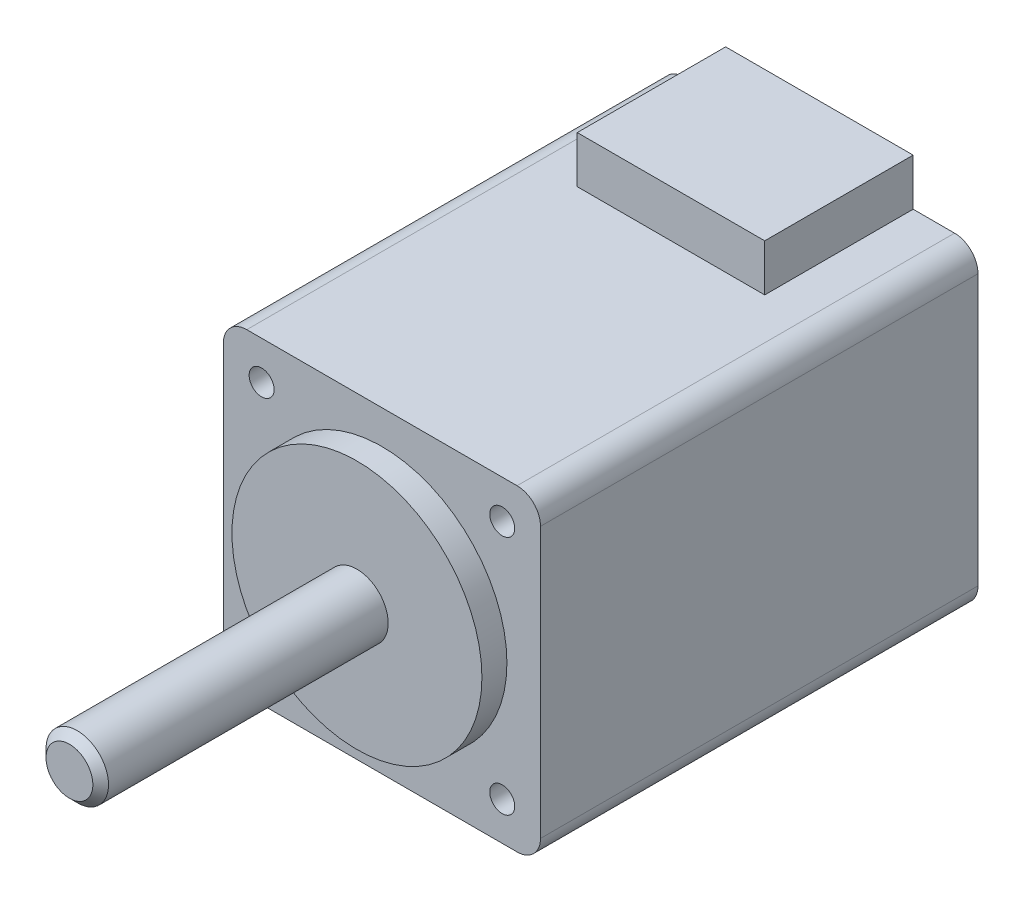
ISO-10303-21;
HEADER;
FILE_DESCRIPTION(('STEP AP214'),'2;1');
FILE_NAME('part.step','',(''),(''),'','','');
FILE_SCHEMA(('AUTOMOTIVE_DESIGN { 1 0 10303 214 1 1 1 1 }'));
ENDSEC;
DATA;
#1=APPLICATION_CONTEXT('core data for automotive mechanical design processes');
#2=APPLICATION_PROTOCOL_DEFINITION('international standard','automotive_design',2000,#1);
#3=PRODUCT_CONTEXT('',#1,'mechanical');
#4=PRODUCT('Part','Part','',(#3));
#5=PRODUCT_RELATED_PRODUCT_CATEGORY('part','',(#4));
#6=PRODUCT_DEFINITION_FORMATION('','',#4);
#7=PRODUCT_DEFINITION_CONTEXT('part definition',#1,'design');
#8=PRODUCT_DEFINITION('design','',#6,#7);
#9=PRODUCT_DEFINITION_SHAPE('','',#8);
#10=(LENGTH_UNIT() NAMED_UNIT(*) SI_UNIT(.MILLI.,.METRE.));
#11=(NAMED_UNIT(*) PLANE_ANGLE_UNIT() SI_UNIT($,.RADIAN.));
#12=(NAMED_UNIT(*) SI_UNIT($,.STERADIAN.) SOLID_ANGLE_UNIT());
#13=UNCERTAINTY_MEASURE_WITH_UNIT(LENGTH_MEASURE(1.E-05),#10,'distance_accuracy_value','');
#14=(GEOMETRIC_REPRESENTATION_CONTEXT(3) GLOBAL_UNCERTAINTY_ASSIGNED_CONTEXT((#13)) GLOBAL_UNIT_ASSIGNED_CONTEXT((#10,
#11,#12)) REPRESENTATION_CONTEXT('',''));
#15=CARTESIAN_POINT('',(0.,0.,0.));
#16=DIRECTION('',(0.,0.,1.));
#17=DIRECTION('',(1.,0.,0.));
#18=AXIS2_PLACEMENT_3D('',#15,#16,#17);
#19=CARTESIAN_POINT('',(0.,0.,0.));
#20=DIRECTION('',(0.,0.,1.));
#21=DIRECTION('',(1.,0.,0.));
#22=AXIS2_PLACEMENT_3D('',#19,#20,#21);
#23=PLANE('',#22);
#24=CARTESIAN_POINT('',(0.,0.,0.));
#25=DIRECTION('',(0.,0.,1.));
#26=DIRECTION('',(1.,0.,0.));
#27=AXIS2_PLACEMENT_3D('',#24,#25,#26);
#28=CIRCLE('',#27,8.);
#29=CARTESIAN_POINT('',(8.,0.,0.));
#30=VERTEX_POINT('',#29);
#31=EDGE_CURVE('E184',#30,#30,#28,.T.);
#32=ORIENTED_EDGE('',*,*,#31,.T.);
#33=EDGE_LOOP('',(#32));
#34=FACE_BOUND('',#33,.T.);
#35=CARTESIAN_POINT('',(0.,0.,0.));
#36=DIRECTION('',(0.,0.,1.));
#37=DIRECTION('',(1.,0.,0.));
#38=AXIS2_PLACEMENT_3D('',#35,#36,#37);
#39=CIRCLE('',#38,2.);
#40=CARTESIAN_POINT('',(2.,0.,0.));
#41=VERTEX_POINT('',#40);
#42=EDGE_CURVE('E181',#41,#41,#39,.T.);
#43=ORIENTED_EDGE('',*,*,#42,.F.);
#44=EDGE_LOOP('',(#43));
#45=FACE_BOUND('',#44,.T.);
#46=ADVANCED_FACE('F37',(#34,#45),#23,.T.);
#47=CARTESIAN_POINT('',(0.,0.,-1.6));
#48=DIRECTION('',(0.,0.,1.));
#49=DIRECTION('',(1.,0.,0.));
#50=AXIS2_PLACEMENT_3D('',#47,#48,#49);
#51=CYLINDRICAL_SURFACE('',#50,8.);
#52=CARTESIAN_POINT('',(0.,0.,-1.6));
#53=DIRECTION('',(0.,0.,1.));
#54=DIRECTION('',(1.,0.,0.));
#55=AXIS2_PLACEMENT_3D('',#52,#53,#54);
#56=CIRCLE('',#55,8.);
#57=CARTESIAN_POINT('',(8.,0.,-1.6));
#58=VERTEX_POINT('',#57);
#59=EDGE_CURVE('E178',#58,#58,#56,.F.);
#60=ORIENTED_EDGE('',*,*,#59,.F.);
#61=EDGE_LOOP('',(#60));
#62=FACE_BOUND('',#61,.T.);
#63=ORIENTED_EDGE('',*,*,#31,.F.);
#64=EDGE_LOOP('',(#63));
#65=FACE_BOUND('',#64,.T.);
#66=ADVANCED_FACE('F205',(#62,#65),#51,.T.);
#67=CARTESIAN_POINT('',(0.,0.,18.4));
#68=DIRECTION('',(0.,0.,-1.));
#69=DIRECTION('',(-1.,0.,0.));
#70=AXIS2_PLACEMENT_3D('',#67,#68,#69);
#71=CYLINDRICAL_SURFACE('',#70,2.);
#72=CARTESIAN_POINT('',(0.,0.,17.9));
#73=DIRECTION('',(0.,0.,1.));
#74=DIRECTION('',(1.,0.,0.));
#75=AXIS2_PLACEMENT_3D('',#72,#73,#74);
#76=CIRCLE('',#75,2.);
#77=CARTESIAN_POINT('',(2.,0.,17.9));
#78=VERTEX_POINT('',#77);
#79=EDGE_CURVE('E11',#78,#78,#76,.F.);
#80=ORIENTED_EDGE('',*,*,#79,.T.);
#81=EDGE_LOOP('',(#80));
#82=FACE_BOUND('',#81,.T.);
#83=ORIENTED_EDGE('',*,*,#42,.T.);
#84=EDGE_LOOP('',(#83));
#85=FACE_BOUND('',#84,.T.);
#86=ADVANCED_FACE('F201',(#82,#85),#71,.T.);
#87=CARTESIAN_POINT('',(0.,0.,18.4));
#88=DIRECTION('',(0.,0.,1.));
#89=DIRECTION('',(1.,0.,0.));
#90=AXIS2_PLACEMENT_3D('',#87,#88,#89);
#91=PLANE('',#90);
#92=CARTESIAN_POINT('',(0.,0.,18.4));
#93=DIRECTION('',(0.,0.,1.));
#94=DIRECTION('',(1.,0.,0.));
#95=AXIS2_PLACEMENT_3D('',#92,#93,#94);
#96=CIRCLE('',#95,1.5);
#97=CARTESIAN_POINT('',(1.5,0.,18.4));
#98=VERTEX_POINT('',#97);
#99=EDGE_CURVE('E45',#98,#98,#96,.T.);
#100=ORIENTED_EDGE('',*,*,#99,.T.);
#101=EDGE_LOOP('',(#100));
#102=FACE_BOUND('',#101,.T.);
#103=ADVANCED_FACE('F189',(#102),#91,.T.);
#104=CARTESIAN_POINT('',(0.,0.,18.4));
#105=DIRECTION('',(0.,0.,-1.));
#106=DIRECTION('',(-1.,0.,0.));
#107=AXIS2_PLACEMENT_3D('',#104,#105,#106);
#108=CONICAL_SURFACE('',#107,1.5,0.78539816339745);
#109=ORIENTED_EDGE('',*,*,#79,.F.);
#110=EDGE_LOOP('',(#109));
#111=FACE_BOUND('',#110,.T.);
#112=ORIENTED_EDGE('',*,*,#99,.F.);
#113=EDGE_LOOP('',(#112));
#114=FACE_BOUND('',#113,.T.);
#115=ADVANCED_FACE('F39',(#111,#114),#108,.T.);
#116=CARTESIAN_POINT('',(8.65,8.65,-29.6));
#117=DIRECTION('',(0.,0.,1.));
#118=DIRECTION('',(1.,0.,0.));
#119=AXIS2_PLACEMENT_3D('',#116,#117,#118);
#120=CYLINDRICAL_SURFACE('',#119,1.5);
#121=CARTESIAN_POINT('',(8.65,8.65,-1.6));
#122=DIRECTION('',(0.,0.,-1.));
#123=DIRECTION('',(1.,0.,0.));
#124=AXIS2_PLACEMENT_3D('',#121,#122,#123);
#125=CIRCLE('',#124,1.5);
#126=CARTESIAN_POINT('',(8.64999999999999,10.15,-1.6));
#127=VERTEX_POINT('',#126);
#128=CARTESIAN_POINT('',(10.15,8.64999999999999,-1.6));
#129=VERTEX_POINT('',#128);
#130=EDGE_CURVE('E148',#127,#129,#125,.T.);
#131=ORIENTED_EDGE('',*,*,#130,.T.);
#132=DIRECTION('',(0.,0.,1.));
#133=VECTOR('',#132,1.);
#134=CARTESIAN_POINT('',(10.15,8.64999999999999,-29.6));
#135=LINE('',#134,#133);
#136=CARTESIAN_POINT('',(10.15,8.64999999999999,-29.6));
#137=VERTEX_POINT('',#136);
#138=EDGE_CURVE('E172',#137,#129,#135,.T.);
#139=ORIENTED_EDGE('',*,*,#138,.F.);
#140=CARTESIAN_POINT('',(8.65,8.65,-29.6));
#141=DIRECTION('',(0.,0.,-1.));
#142=DIRECTION('',(1.,0.,0.));
#143=AXIS2_PLACEMENT_3D('',#140,#141,#142);
#144=CIRCLE('',#143,1.5);
#145=CARTESIAN_POINT('',(8.64999999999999,10.15,-29.6));
#146=VERTEX_POINT('',#145);
#147=EDGE_CURVE('E349',#146,#137,#144,.T.);
#148=ORIENTED_EDGE('',*,*,#147,.F.);
#149=DIRECTION('',(0.,0.,1.));
#150=VECTOR('',#149,1.);
#151=CARTESIAN_POINT('',(8.64999999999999,10.15,-29.6));
#152=LINE('',#151,#150);
#153=EDGE_CURVE('E175',#146,#127,#152,.T.);
#154=ORIENTED_EDGE('',*,*,#153,.T.);
#155=EDGE_LOOP('',(#131,#139,#148,#154));
#156=FACE_BOUND('',#155,.T.);
#157=ADVANCED_FACE('F192',(#156),#120,.T.);
#158=CARTESIAN_POINT('',(10.15,-8.65,-29.6));
#159=DIRECTION('',(-1.,0.,0.));
#160=DIRECTION('',(0.,0.,1.));
#161=AXIS2_PLACEMENT_3D('',#158,#159,#160);
#162=PLANE('',#161);
#163=DIRECTION('',(0.,-1.,0.));
#164=VECTOR('',#163,1.);
#165=CARTESIAN_POINT('',(10.15,-8.65,-1.6));
#166=LINE('',#165,#164);
#167=CARTESIAN_POINT('',(10.15,-8.65,-1.6));
#168=VERTEX_POINT('',#167);
#169=EDGE_CURVE('E150',#129,#168,#166,.T.);
#170=ORIENTED_EDGE('',*,*,#169,.T.);
#171=DIRECTION('',(0.,0.,1.));
#172=VECTOR('',#171,1.);
#173=CARTESIAN_POINT('',(10.15,-8.65,-29.6));
#174=LINE('',#173,#172);
#175=CARTESIAN_POINT('',(10.15,-8.65,-29.6));
#176=VERTEX_POINT('',#175);
#177=EDGE_CURVE('E169',#176,#168,#174,.T.);
#178=ORIENTED_EDGE('',*,*,#177,.F.);
#179=DIRECTION('',(0.,-1.,0.));
#180=VECTOR('',#179,1.);
#181=CARTESIAN_POINT('',(10.15,-8.65,-29.6));
#182=LINE('',#181,#180);
#183=EDGE_CURVE('E351',#137,#176,#182,.T.);
#184=ORIENTED_EDGE('',*,*,#183,.F.);
#185=ORIENTED_EDGE('',*,*,#138,.T.);
#186=EDGE_LOOP('',(#170,#178,#184,#185));
#187=FACE_BOUND('',#186,.T.);
#188=ADVANCED_FACE('F198',(#187),#162,.F.);
#189=CARTESIAN_POINT('',(8.65,-8.65000000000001,-29.6));
#190=DIRECTION('',(0.,0.,1.));
#191=DIRECTION('',(1.,0.,0.));
#192=AXIS2_PLACEMENT_3D('',#189,#190,#191);
#193=CYLINDRICAL_SURFACE('',#192,1.5);
#194=CARTESIAN_POINT('',(8.65,-8.65000000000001,-1.6));
#195=DIRECTION('',(0.,0.,-1.));
#196=DIRECTION('',(1.,0.,0.));
#197=AXIS2_PLACEMENT_3D('',#194,#195,#196);
#198=CIRCLE('',#197,1.5);
#199=CARTESIAN_POINT('',(8.64999999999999,-10.15,-1.6));
#200=VERTEX_POINT('',#199);
#201=EDGE_CURVE('E153',#168,#200,#198,.T.);
#202=ORIENTED_EDGE('',*,*,#201,.T.);
#203=DIRECTION('',(0.,0.,1.));
#204=VECTOR('',#203,1.);
#205=CARTESIAN_POINT('',(8.64999999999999,-10.15,-29.6));
#206=LINE('',#205,#204);
#207=CARTESIAN_POINT('',(8.64999999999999,-10.15,-29.6));
#208=VERTEX_POINT('',#207);
#209=EDGE_CURVE('E166',#208,#200,#206,.T.);
#210=ORIENTED_EDGE('',*,*,#209,.F.);
#211=CARTESIAN_POINT('',(8.65,-8.65000000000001,-29.6));
#212=DIRECTION('',(0.,0.,-1.));
#213=DIRECTION('',(1.,0.,0.));
#214=AXIS2_PLACEMENT_3D('',#211,#212,#213);
#215=CIRCLE('',#214,1.5);
#216=EDGE_CURVE('E353',#176,#208,#215,.T.);
#217=ORIENTED_EDGE('',*,*,#216,.F.);
#218=ORIENTED_EDGE('',*,*,#177,.T.);
#219=EDGE_LOOP('',(#202,#210,#217,#218));
#220=FACE_BOUND('',#219,.T.);
#221=ADVANCED_FACE('F219',(#220),#193,.T.);
#222=CARTESIAN_POINT('',(-8.64999999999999,-10.15,-29.6));
#223=DIRECTION('',(0.,1.,0.));
#224=DIRECTION('',(-1.,0.,0.));
#225=AXIS2_PLACEMENT_3D('',#222,#223,#224);
#226=PLANE('',#225);
#227=DIRECTION('',(-1.,0.,0.));
#228=VECTOR('',#227,1.);
#229=CARTESIAN_POINT('',(-8.64999999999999,-10.15,-1.6));
#230=LINE('',#229,#228);
#231=CARTESIAN_POINT('',(-8.64999999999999,-10.15,-1.6));
#232=VERTEX_POINT('',#231);
#233=EDGE_CURVE('E155',#200,#232,#230,.T.);
#234=ORIENTED_EDGE('',*,*,#233,.T.);
#235=DIRECTION('',(0.,0.,1.));
#236=VECTOR('',#235,1.);
#237=CARTESIAN_POINT('',(-8.64999999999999,-10.15,-29.6));
#238=LINE('',#237,#236);
#239=CARTESIAN_POINT('',(-8.64999999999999,-10.15,-29.6));
#240=VERTEX_POINT('',#239);
#241=EDGE_CURVE('E137',#240,#232,#238,.T.);
#242=ORIENTED_EDGE('',*,*,#241,.F.);
#243=DIRECTION('',(-1.,0.,0.));
#244=VECTOR('',#243,1.);
#245=CARTESIAN_POINT('',(-8.64999999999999,-10.15,-29.6));
#246=LINE('',#245,#244);
#247=EDGE_CURVE('E125',#208,#240,#246,.T.);
#248=ORIENTED_EDGE('',*,*,#247,.F.);
#249=ORIENTED_EDGE('',*,*,#209,.T.);
#250=EDGE_LOOP('',(#234,#242,#248,#249));
#251=FACE_BOUND('',#250,.T.);
#252=ADVANCED_FACE('F223',(#251),#226,.F.);
#253=CARTESIAN_POINT('',(-8.65,-8.65,-29.6));
#254=DIRECTION('',(0.,0.,1.));
#255=DIRECTION('',(1.,0.,0.));
#256=AXIS2_PLACEMENT_3D('',#253,#254,#255);
#257=CYLINDRICAL_SURFACE('',#256,1.5);
#258=CARTESIAN_POINT('',(-8.65,-8.65,-1.6));
#259=DIRECTION('',(0.,0.,-1.));
#260=DIRECTION('',(1.,0.,0.));
#261=AXIS2_PLACEMENT_3D('',#258,#259,#260);
#262=CIRCLE('',#261,1.5);
#263=CARTESIAN_POINT('',(-10.15,-8.64999999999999,-1.6));
#264=VERTEX_POINT('',#263);
#265=EDGE_CURVE('E134',#232,#264,#262,.T.);
#266=ORIENTED_EDGE('',*,*,#265,.T.);
#267=DIRECTION('',(0.,0.,1.));
#268=VECTOR('',#267,1.);
#269=CARTESIAN_POINT('',(-10.15,-8.64999999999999,-29.6));
#270=LINE('',#269,#268);
#271=CARTESIAN_POINT('',(-10.15,-8.64999999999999,-29.6));
#272=VERTEX_POINT('',#271);
#273=EDGE_CURVE('E131',#272,#264,#270,.T.);
#274=ORIENTED_EDGE('',*,*,#273,.F.);
#275=CARTESIAN_POINT('',(-8.65,-8.65,-29.6));
#276=DIRECTION('',(0.,0.,-1.));
#277=DIRECTION('',(1.,0.,0.));
#278=AXIS2_PLACEMENT_3D('',#275,#276,#277);
#279=CIRCLE('',#278,1.5);
#280=EDGE_CURVE('E118',#240,#272,#279,.T.);
#281=ORIENTED_EDGE('',*,*,#280,.F.);
#282=ORIENTED_EDGE('',*,*,#241,.T.);
#283=EDGE_LOOP('',(#266,#274,#281,#282));
#284=FACE_BOUND('',#283,.T.);
#285=ADVANCED_FACE('F132',(#284),#257,.T.);
#286=CARTESIAN_POINT('',(-10.15,8.64999999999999,-29.6));
#287=DIRECTION('',(1.,0.,0.));
#288=DIRECTION('',(0.,1.,0.));
#289=AXIS2_PLACEMENT_3D('',#286,#287,#288);
#290=PLANE('',#289);
#291=DIRECTION('',(0.,1.,0.));
#292=VECTOR('',#291,1.);
#293=CARTESIAN_POINT('',(-10.15,8.64999999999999,-1.6));
#294=LINE('',#293,#292);
#295=CARTESIAN_POINT('',(-10.15,8.64999999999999,-1.6));
#296=VERTEX_POINT('',#295);
#297=EDGE_CURVE('E158',#264,#296,#294,.T.);
#298=ORIENTED_EDGE('',*,*,#297,.T.);
#299=DIRECTION('',(0.,0.,1.));
#300=VECTOR('',#299,1.);
#301=CARTESIAN_POINT('',(-10.15,8.64999999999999,-29.6));
#302=LINE('',#301,#300);
#303=CARTESIAN_POINT('',(-10.15,8.64999999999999,-29.6));
#304=VERTEX_POINT('',#303);
#305=EDGE_CURVE('E138',#304,#296,#302,.T.);
#306=ORIENTED_EDGE('',*,*,#305,.F.);
#307=DIRECTION('',(0.,1.,0.));
#308=VECTOR('',#307,1.);
#309=CARTESIAN_POINT('',(-10.15,8.64999999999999,-29.6));
#310=LINE('',#309,#308);
#311=EDGE_CURVE('E122',#272,#304,#310,.T.);
#312=ORIENTED_EDGE('',*,*,#311,.F.);
#313=ORIENTED_EDGE('',*,*,#273,.T.);
#314=EDGE_LOOP('',(#298,#306,#312,#313));
#315=FACE_BOUND('',#314,.T.);
#316=ADVANCED_FACE('F140',(#315),#290,.F.);
#317=CARTESIAN_POINT('',(-8.65,8.65,-29.6));
#318=DIRECTION('',(0.,0.,1.));
#319=DIRECTION('',(1.,0.,0.));
#320=AXIS2_PLACEMENT_3D('',#317,#318,#319);
#321=CYLINDRICAL_SURFACE('',#320,1.5);
#322=CARTESIAN_POINT('',(-8.65,8.65,-1.6));
#323=DIRECTION('',(0.,0.,-1.));
#324=DIRECTION('',(1.,0.,0.));
#325=AXIS2_PLACEMENT_3D('',#322,#323,#324);
#326=CIRCLE('',#325,1.5);
#327=CARTESIAN_POINT('',(-8.64999999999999,10.15,-1.6));
#328=VERTEX_POINT('',#327);
#329=EDGE_CURVE('E96',#296,#328,#326,.T.);
#330=ORIENTED_EDGE('',*,*,#329,.T.);
#331=DIRECTION('',(0.,0.,1.));
#332=VECTOR('',#331,1.);
#333=CARTESIAN_POINT('',(-8.64999999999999,10.15,-29.6));
#334=LINE('',#333,#332);
#335=CARTESIAN_POINT('',(-8.64999999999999,10.15,-29.6));
#336=VERTEX_POINT('',#335);
#337=EDGE_CURVE('E144',#336,#328,#334,.T.);
#338=ORIENTED_EDGE('',*,*,#337,.F.);
#339=CARTESIAN_POINT('',(-8.65,8.65,-29.6));
#340=DIRECTION('',(0.,0.,-1.));
#341=DIRECTION('',(1.,0.,0.));
#342=AXIS2_PLACEMENT_3D('',#339,#340,#341);
#343=CIRCLE('',#342,1.5);
#344=EDGE_CURVE('E142',#304,#336,#343,.T.);
#345=ORIENTED_EDGE('',*,*,#344,.F.);
#346=ORIENTED_EDGE('',*,*,#305,.T.);
#347=EDGE_LOOP('',(#330,#338,#345,#346));
#348=FACE_BOUND('',#347,.T.);
#349=ADVANCED_FACE('F232',(#348),#321,.T.);
#350=CARTESIAN_POINT('',(0.,10.15,-29.6));
#351=DIRECTION('',(0.,-1.,0.));
#352=DIRECTION('',(0.,0.,-1.));
#353=AXIS2_PLACEMENT_3D('',#350,#351,#352);
#354=PLANE('',#353);
#355=DIRECTION('',(1.,0.,0.));
#356=VECTOR('',#355,1.);
#357=CARTESIAN_POINT('',(8.64999999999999,10.15,-29.6));
#358=LINE('',#357,#356);
#359=CARTESIAN_POINT('',(6.,10.15,-29.6));
#360=VERTEX_POINT('',#359);
#361=EDGE_CURVE('E101',#360,#146,#358,.T.);
#362=ORIENTED_EDGE('',*,*,#361,.F.);
#363=DIRECTION('',(0.,0.,-1.));
#364=VECTOR('',#363,1.);
#365=CARTESIAN_POINT('',(6.,10.15,-20.1));
#366=LINE('',#365,#364);
#367=CARTESIAN_POINT('',(6.,10.15,-20.1));
#368=VERTEX_POINT('',#367);
#369=EDGE_CURVE('E151',#368,#360,#366,.T.);
#370=ORIENTED_EDGE('',*,*,#369,.F.);
#371=DIRECTION('',(-1.,0.,0.));
#372=VECTOR('',#371,1.);
#373=CARTESIAN_POINT('',(6.,10.15,-20.1));
#374=LINE('',#373,#372);
#375=CARTESIAN_POINT('',(-6.,10.15,-20.1));
#376=VERTEX_POINT('',#375);
#377=EDGE_CURVE('E322',#368,#376,#374,.T.);
#378=ORIENTED_EDGE('',*,*,#377,.T.);
#379=DIRECTION('',(0.,0.,-1.));
#380=VECTOR('',#379,1.);
#381=CARTESIAN_POINT('',(-6.,10.15,-20.1));
#382=LINE('',#381,#380);
#383=CARTESIAN_POINT('',(-6.,10.15,-29.6));
#384=VERTEX_POINT('',#383);
#385=EDGE_CURVE('E334',#376,#384,#382,.T.);
#386=ORIENTED_EDGE('',*,*,#385,.T.);
#387=EDGE_CURVE('E61',#336,#384,#358,.T.);
#388=ORIENTED_EDGE('',*,*,#387,.F.);
#389=ORIENTED_EDGE('',*,*,#337,.T.);
#390=DIRECTION('',(1.,0.,0.));
#391=VECTOR('',#390,1.);
#392=CARTESIAN_POINT('',(0.,10.15,-1.6));
#393=LINE('',#392,#391);
#394=EDGE_CURVE('E161',#328,#127,#393,.T.);
#395=ORIENTED_EDGE('',*,*,#394,.T.);
#396=ORIENTED_EDGE('',*,*,#153,.F.);
#397=EDGE_LOOP('',(#362,#370,#378,#386,#388,#389,#395,#396));
#398=FACE_BOUND('',#397,.T.);
#399=ADVANCED_FACE('F235',(#398),#354,.F.);
#400=CARTESIAN_POINT('',(-8.65,8.65,-29.6));
#401=DIRECTION('',(0.,0.,1.));
#402=DIRECTION('',(1.,0.,0.));
#403=AXIS2_PLACEMENT_3D('',#400,#401,#402);
#404=PLANE('',#403);
#405=ORIENTED_EDGE('',*,*,#387,.T.);
#406=DIRECTION('',(0.,1.,0.));
#407=VECTOR('',#406,1.);
#408=CARTESIAN_POINT('',(-6.,10.15,-29.6));
#409=LINE('',#408,#407);
#410=CARTESIAN_POINT('',(-6.,13.15,-29.6));
#411=VERTEX_POINT('',#410);
#412=EDGE_CURVE('E321',#384,#411,#409,.T.);
#413=ORIENTED_EDGE('',*,*,#412,.T.);
#414=DIRECTION('',(1.,0.,0.));
#415=VECTOR('',#414,1.);
#416=CARTESIAN_POINT('',(-6.,13.15,-29.6));
#417=LINE('',#416,#415);
#418=CARTESIAN_POINT('',(6.,13.15,-29.6));
#419=VERTEX_POINT('',#418);
#420=EDGE_CURVE('E337',#411,#419,#417,.T.);
#421=ORIENTED_EDGE('',*,*,#420,.T.);
#422=DIRECTION('',(0.,-1.,0.));
#423=VECTOR('',#422,1.);
#424=CARTESIAN_POINT('',(6.,13.15,-29.6));
#425=LINE('',#424,#423);
#426=EDGE_CURVE('E52',#419,#360,#425,.T.);
#427=ORIENTED_EDGE('',*,*,#426,.T.);
#428=ORIENTED_EDGE('',*,*,#361,.T.);
#429=ORIENTED_EDGE('',*,*,#147,.T.);
#430=ORIENTED_EDGE('',*,*,#183,.T.);
#431=ORIENTED_EDGE('',*,*,#216,.T.);
#432=ORIENTED_EDGE('',*,*,#247,.T.);
#433=ORIENTED_EDGE('',*,*,#280,.T.);
#434=ORIENTED_EDGE('',*,*,#311,.T.);
#435=ORIENTED_EDGE('',*,*,#344,.T.);
#436=EDGE_LOOP('',(#405,#413,#421,#427,#428,#429,#430,#431,#432,#433,#434,#435));
#437=FACE_BOUND('',#436,.T.);
#438=ADVANCED_FACE('F120',(#437),#404,.F.);
#439=CARTESIAN_POINT('',(-8.65,8.65,-1.6));
#440=DIRECTION('',(0.,0.,1.));
#441=DIRECTION('',(1.,0.,0.));
#442=AXIS2_PLACEMENT_3D('',#439,#440,#441);
#443=PLANE('',#442);
#444=CARTESIAN_POINT('',(-7.7,7.7,-1.6));
#445=DIRECTION('',(0.,0.,1.));
#446=DIRECTION('',(1.,0.,0.));
#447=AXIS2_PLACEMENT_3D('',#444,#445,#446);
#448=CIRCLE('',#447,0.799999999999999);
#449=CARTESIAN_POINT('',(-6.9,7.7,-1.6));
#450=VERTEX_POINT('',#449);
#451=EDGE_CURVE('E299',#450,#450,#448,.T.);
#452=ORIENTED_EDGE('',*,*,#451,.F.);
#453=EDGE_LOOP('',(#452));
#454=FACE_BOUND('',#453,.T.);
#455=CARTESIAN_POINT('',(7.7,7.7,-1.6));
#456=DIRECTION('',(0.,0.,1.));
#457=DIRECTION('',(1.,0.,0.));
#458=AXIS2_PLACEMENT_3D('',#455,#456,#457);
#459=CIRCLE('',#458,0.799999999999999);
#460=CARTESIAN_POINT('',(8.5,7.7,-1.6));
#461=VERTEX_POINT('',#460);
#462=EDGE_CURVE('E301',#461,#461,#459,.T.);
#463=ORIENTED_EDGE('',*,*,#462,.F.);
#464=EDGE_LOOP('',(#463));
#465=FACE_BOUND('',#464,.T.);
#466=CARTESIAN_POINT('',(7.7,-7.7,-1.6));
#467=DIRECTION('',(0.,0.,1.));
#468=DIRECTION('',(1.,0.,0.));
#469=AXIS2_PLACEMENT_3D('',#466,#467,#468);
#470=CIRCLE('',#469,0.799999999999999);
#471=CARTESIAN_POINT('',(8.5,-7.7,-1.6));
#472=VERTEX_POINT('',#471);
#473=EDGE_CURVE('E309',#472,#472,#470,.T.);
#474=ORIENTED_EDGE('',*,*,#473,.F.);
#475=EDGE_LOOP('',(#474));
#476=FACE_BOUND('',#475,.T.);
#477=CARTESIAN_POINT('',(-7.7,-7.7,-1.6));
#478=DIRECTION('',(0.,0.,1.));
#479=DIRECTION('',(1.,0.,0.));
#480=AXIS2_PLACEMENT_3D('',#477,#478,#479);
#481=CIRCLE('',#480,0.799999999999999);
#482=CARTESIAN_POINT('',(-6.9,-7.7,-1.6));
#483=VERTEX_POINT('',#482);
#484=EDGE_CURVE('E315',#483,#483,#481,.T.);
#485=ORIENTED_EDGE('',*,*,#484,.F.);
#486=EDGE_LOOP('',(#485));
#487=FACE_BOUND('',#486,.T.);
#488=ORIENTED_EDGE('',*,*,#59,.T.);
#489=EDGE_LOOP('',(#488));
#490=FACE_BOUND('',#489,.T.);
#491=ORIENTED_EDGE('',*,*,#130,.F.);
#492=ORIENTED_EDGE('',*,*,#394,.F.);
#493=ORIENTED_EDGE('',*,*,#329,.F.);
#494=ORIENTED_EDGE('',*,*,#297,.F.);
#495=ORIENTED_EDGE('',*,*,#265,.F.);
#496=ORIENTED_EDGE('',*,*,#233,.F.);
#497=ORIENTED_EDGE('',*,*,#201,.F.);
#498=ORIENTED_EDGE('',*,*,#169,.F.);
#499=EDGE_LOOP('',(#491,#492,#493,#494,#495,#496,#497,#498));
#500=FACE_BOUND('',#499,.T.);
#501=ADVANCED_FACE('F238',(#454,#465,#476,#487,#490,#500),#443,.T.);
#502=CARTESIAN_POINT('',(6.,13.15,-20.1));
#503=DIRECTION('',(1.,0.,0.));
#504=DIRECTION('',(0.,1.,0.));
#505=AXIS2_PLACEMENT_3D('',#502,#503,#504);
#506=PLANE('',#505);
#507=ORIENTED_EDGE('',*,*,#426,.F.);
#508=DIRECTION('',(0.,0.,-1.));
#509=VECTOR('',#508,1.);
#510=CARTESIAN_POINT('',(6.,13.15,-20.1));
#511=LINE('',#510,#509);
#512=CARTESIAN_POINT('',(6.,13.15,-20.1));
#513=VERTEX_POINT('',#512);
#514=EDGE_CURVE('E341',#513,#419,#511,.T.);
#515=ORIENTED_EDGE('',*,*,#514,.F.);
#516=DIRECTION('',(0.,-1.,0.));
#517=VECTOR('',#516,1.);
#518=CARTESIAN_POINT('',(6.,13.15,-20.1));
#519=LINE('',#518,#517);
#520=EDGE_CURVE('E331',#513,#368,#519,.T.);
#521=ORIENTED_EDGE('',*,*,#520,.T.);
#522=ORIENTED_EDGE('',*,*,#369,.T.);
#523=EDGE_LOOP('',(#507,#515,#521,#522));
#524=FACE_BOUND('',#523,.T.);
#525=ADVANCED_FACE('F241',(#524),#506,.T.);
#526=CARTESIAN_POINT('',(-6.,13.15,-20.1));
#527=DIRECTION('',(0.,1.,0.));
#528=DIRECTION('',(-1.,0.,0.));
#529=AXIS2_PLACEMENT_3D('',#526,#527,#528);
#530=PLANE('',#529);
#531=ORIENTED_EDGE('',*,*,#420,.F.);
#532=DIRECTION('',(0.,0.,-1.));
#533=VECTOR('',#532,1.);
#534=CARTESIAN_POINT('',(-6.,13.15,-20.1));
#535=LINE('',#534,#533);
#536=CARTESIAN_POINT('',(-6.,13.15,-20.1));
#537=VERTEX_POINT('',#536);
#538=EDGE_CURVE('E344',#537,#411,#535,.T.);
#539=ORIENTED_EDGE('',*,*,#538,.F.);
#540=DIRECTION('',(1.,0.,0.));
#541=VECTOR('',#540,1.);
#542=CARTESIAN_POINT('',(-6.,13.15,-20.1));
#543=LINE('',#542,#541);
#544=EDGE_CURVE('E328',#537,#513,#543,.T.);
#545=ORIENTED_EDGE('',*,*,#544,.T.);
#546=ORIENTED_EDGE('',*,*,#514,.T.);
#547=EDGE_LOOP('',(#531,#539,#545,#546));
#548=FACE_BOUND('',#547,.T.);
#549=ADVANCED_FACE('F249',(#548),#530,.T.);
#550=CARTESIAN_POINT('',(-6.,10.15,-20.1));
#551=DIRECTION('',(-1.,0.,0.));
#552=DIRECTION('',(0.,0.,1.));
#553=AXIS2_PLACEMENT_3D('',#550,#551,#552);
#554=PLANE('',#553);
#555=ORIENTED_EDGE('',*,*,#412,.F.);
#556=ORIENTED_EDGE('',*,*,#385,.F.);
#557=DIRECTION('',(0.,1.,0.));
#558=VECTOR('',#557,1.);
#559=CARTESIAN_POINT('',(-6.,10.15,-20.1));
#560=LINE('',#559,#558);
#561=EDGE_CURVE('E325',#376,#537,#560,.T.);
#562=ORIENTED_EDGE('',*,*,#561,.T.);
#563=ORIENTED_EDGE('',*,*,#538,.T.);
#564=EDGE_LOOP('',(#555,#556,#562,#563));
#565=FACE_BOUND('',#564,.T.);
#566=ADVANCED_FACE('F245',(#565),#554,.T.);
#567=CARTESIAN_POINT('',(0.,0.,-20.1));
#568=DIRECTION('',(0.,0.,-1.));
#569=DIRECTION('',(-1.,0.,0.));
#570=AXIS2_PLACEMENT_3D('',#567,#568,#569);
#571=PLANE('',#570);
#572=ORIENTED_EDGE('',*,*,#377,.F.);
#573=ORIENTED_EDGE('',*,*,#520,.F.);
#574=ORIENTED_EDGE('',*,*,#544,.F.);
#575=ORIENTED_EDGE('',*,*,#561,.F.);
#576=EDGE_LOOP('',(#572,#573,#574,#575));
#577=FACE_BOUND('',#576,.T.);
#578=ADVANCED_FACE('F248',(#577),#571,.F.);
#579=CARTESIAN_POINT('',(-7.7,-7.7,-7.1));
#580=DIRECTION('',(0.,0.,1.));
#581=DIRECTION('',(1.,0.,0.));
#582=AXIS2_PLACEMENT_3D('',#579,#580,#581);
#583=CONICAL_SURFACE('',#582,0.799999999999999,1.02974425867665);
#584=CARTESIAN_POINT('',(-7.7,-7.7,-7.58068849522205));
#585=VERTEX_POINT('',#584);
#586=VERTEX_LOOP('',#585);
#587=FACE_BOUND('',#586,.T.);
#588=CARTESIAN_POINT('',(-7.7,-7.7,-7.1));
#589=DIRECTION('',(0.,0.,1.));
#590=DIRECTION('',(1.,0.,0.));
#591=AXIS2_PLACEMENT_3D('',#588,#589,#590);
#592=CIRCLE('',#591,0.799999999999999);
#593=CARTESIAN_POINT('',(-6.9,-7.7,-7.1));
#594=VERTEX_POINT('',#593);
#595=EDGE_CURVE('E318',#594,#594,#592,.T.);
#596=ORIENTED_EDGE('',*,*,#595,.T.);
#597=EDGE_LOOP('',(#596));
#598=FACE_BOUND('',#597,.T.);
#599=ADVANCED_FACE('F259',(#587,#598),#583,.F.);
#600=CARTESIAN_POINT('',(-7.7,-7.7,-1.6));
#601=DIRECTION('',(0.,0.,1.));
#602=DIRECTION('',(1.,0.,0.));
#603=AXIS2_PLACEMENT_3D('',#600,#601,#602);
#604=CYLINDRICAL_SURFACE('',#603,0.799999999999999);
#605=ORIENTED_EDGE('',*,*,#595,.F.);
#606=EDGE_LOOP('',(#605));
#607=FACE_BOUND('',#606,.T.);
#608=ORIENTED_EDGE('',*,*,#484,.T.);
#609=EDGE_LOOP('',(#608));
#610=FACE_BOUND('',#609,.T.);
#611=ADVANCED_FACE('F263',(#607,#610),#604,.F.);
#612=CARTESIAN_POINT('',(7.7,-7.7,-7.1));
#613=DIRECTION('',(0.,0.,1.));
#614=DIRECTION('',(1.,0.,0.));
#615=AXIS2_PLACEMENT_3D('',#612,#613,#614);
#616=CONICAL_SURFACE('',#615,0.799999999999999,1.02974425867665);
#617=CARTESIAN_POINT('',(7.7,-7.7,-7.58068849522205));
#618=VERTEX_POINT('',#617);
#619=VERTEX_LOOP('',#618);
#620=FACE_BOUND('',#619,.T.);
#621=CARTESIAN_POINT('',(7.7,-7.7,-7.1));
#622=DIRECTION('',(0.,0.,1.));
#623=DIRECTION('',(1.,0.,0.));
#624=AXIS2_PLACEMENT_3D('',#621,#622,#623);
#625=CIRCLE('',#624,0.799999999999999);
#626=CARTESIAN_POINT('',(8.5,-7.7,-7.1));
#627=VERTEX_POINT('',#626);
#628=EDGE_CURVE('E312',#627,#627,#625,.T.);
#629=ORIENTED_EDGE('',*,*,#628,.T.);
#630=EDGE_LOOP('',(#629));
#631=FACE_BOUND('',#630,.T.);
#632=ADVANCED_FACE('F267',(#620,#631),#616,.F.);
#633=CARTESIAN_POINT('',(7.7,-7.7,-1.6));
#634=DIRECTION('',(0.,0.,1.));
#635=DIRECTION('',(1.,0.,0.));
#636=AXIS2_PLACEMENT_3D('',#633,#634,#635);
#637=CYLINDRICAL_SURFACE('',#636,0.799999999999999);
#638=ORIENTED_EDGE('',*,*,#628,.F.);
#639=EDGE_LOOP('',(#638));
#640=FACE_BOUND('',#639,.T.);
#641=ORIENTED_EDGE('',*,*,#473,.T.);
#642=EDGE_LOOP('',(#641));
#643=FACE_BOUND('',#642,.T.);
#644=ADVANCED_FACE('F271',(#640,#643),#637,.F.);
#645=CARTESIAN_POINT('',(7.7,7.7,-7.1));
#646=DIRECTION('',(0.,0.,1.));
#647=DIRECTION('',(1.,0.,0.));
#648=AXIS2_PLACEMENT_3D('',#645,#646,#647);
#649=CONICAL_SURFACE('',#648,0.799999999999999,1.02974425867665);
#650=CARTESIAN_POINT('',(7.7,7.7,-7.58068849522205));
#651=VERTEX_POINT('',#650);
#652=VERTEX_LOOP('',#651);
#653=FACE_BOUND('',#652,.T.);
#654=CARTESIAN_POINT('',(7.7,7.7,-7.1));
#655=DIRECTION('',(0.,0.,1.));
#656=DIRECTION('',(1.,0.,0.));
#657=AXIS2_PLACEMENT_3D('',#654,#655,#656);
#658=CIRCLE('',#657,0.799999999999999);
#659=CARTESIAN_POINT('',(8.5,7.7,-7.1));
#660=VERTEX_POINT('',#659);
#661=EDGE_CURVE('E306',#660,#660,#658,.T.);
#662=ORIENTED_EDGE('',*,*,#661,.T.);
#663=EDGE_LOOP('',(#662));
#664=FACE_BOUND('',#663,.T.);
#665=ADVANCED_FACE('F275',(#653,#664),#649,.F.);
#666=CARTESIAN_POINT('',(7.7,7.7,-1.6));
#667=DIRECTION('',(0.,0.,1.));
#668=DIRECTION('',(1.,0.,0.));
#669=AXIS2_PLACEMENT_3D('',#666,#667,#668);
#670=CYLINDRICAL_SURFACE('',#669,0.799999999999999);
#671=ORIENTED_EDGE('',*,*,#661,.F.);
#672=EDGE_LOOP('',(#671));
#673=FACE_BOUND('',#672,.T.);
#674=ORIENTED_EDGE('',*,*,#462,.T.);
#675=EDGE_LOOP('',(#674));
#676=FACE_BOUND('',#675,.T.);
#677=ADVANCED_FACE('F279',(#673,#676),#670,.F.);
#678=CARTESIAN_POINT('',(-7.7,7.7,-7.1));
#679=DIRECTION('',(0.,0.,1.));
#680=DIRECTION('',(1.,0.,0.));
#681=AXIS2_PLACEMENT_3D('',#678,#679,#680);
#682=CONICAL_SURFACE('',#681,0.799999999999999,1.02974425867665);
#683=CARTESIAN_POINT('',(-7.7,7.7,-7.58068849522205));
#684=VERTEX_POINT('',#683);
#685=VERTEX_LOOP('',#684);
#686=FACE_BOUND('',#685,.T.);
#687=CARTESIAN_POINT('',(-7.7,7.7,-7.1));
#688=DIRECTION('',(0.,0.,1.));
#689=DIRECTION('',(1.,0.,0.));
#690=AXIS2_PLACEMENT_3D('',#687,#688,#689);
#691=CIRCLE('',#690,0.799999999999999);
#692=CARTESIAN_POINT('',(-6.9,7.7,-7.1));
#693=VERTEX_POINT('',#692);
#694=EDGE_CURVE('E296',#693,#693,#691,.T.);
#695=ORIENTED_EDGE('',*,*,#694,.T.);
#696=EDGE_LOOP('',(#695));
#697=FACE_BOUND('',#696,.T.);
#698=ADVANCED_FACE('F283',(#686,#697),#682,.F.);
#699=CARTESIAN_POINT('',(-7.7,7.7,-1.6));
#700=DIRECTION('',(0.,0.,1.));
#701=DIRECTION('',(1.,0.,0.));
#702=AXIS2_PLACEMENT_3D('',#699,#700,#701);
#703=CYLINDRICAL_SURFACE('',#702,0.799999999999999);
#704=ORIENTED_EDGE('',*,*,#694,.F.);
#705=EDGE_LOOP('',(#704));
#706=FACE_BOUND('',#705,.T.);
#707=ORIENTED_EDGE('',*,*,#451,.T.);
#708=EDGE_LOOP('',(#707));
#709=FACE_BOUND('',#708,.T.);
#710=ADVANCED_FACE('F287',(#706,#709),#703,.F.);
#711=CLOSED_SHELL('',(#46,#66,#86,#103,#115,#157,#188,#221,#252,#285,#316,#349,#399,#438,#501,
#525,#549,#566,#578,#599,#611,#632,#644,#665,#677,#698,#710));
#712=MANIFOLD_SOLID_BREP('B2',#711);
#713=ADVANCED_BREP_SHAPE_REPRESENTATION('',(#18,#712),#14);
#714=SHAPE_DEFINITION_REPRESENTATION(#9,#713);
ENDSEC;
END-ISO-10303-21;
